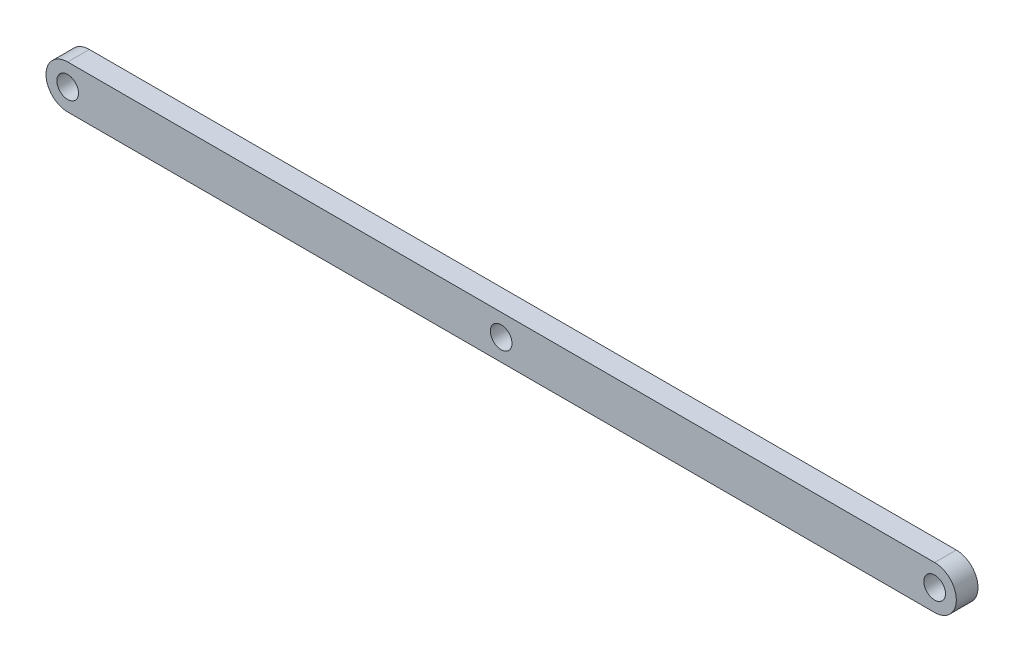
ISO-10303-21;
HEADER;
FILE_DESCRIPTION(('STEP AP214'),'2;1');
FILE_NAME('part.step','',(''),(''),'','','');
FILE_SCHEMA(('AUTOMOTIVE_DESIGN { 1 0 10303 214 1 1 1 1 }'));
ENDSEC;
DATA;
#1=APPLICATION_CONTEXT('core data for automotive mechanical design processes');
#2=APPLICATION_PROTOCOL_DEFINITION('international standard','automotive_design',2000,#1);
#3=PRODUCT_CONTEXT('',#1,'mechanical');
#4=PRODUCT('Part','Part','',(#3));
#5=PRODUCT_RELATED_PRODUCT_CATEGORY('part','',(#4));
#6=PRODUCT_DEFINITION_FORMATION('','',#4);
#7=PRODUCT_DEFINITION_CONTEXT('part definition',#1,'design');
#8=PRODUCT_DEFINITION('design','',#6,#7);
#9=PRODUCT_DEFINITION_SHAPE('','',#8);
#10=(LENGTH_UNIT() NAMED_UNIT(*) SI_UNIT(.MILLI.,.METRE.));
#11=(NAMED_UNIT(*) PLANE_ANGLE_UNIT() SI_UNIT($,.RADIAN.));
#12=(NAMED_UNIT(*) SI_UNIT($,.STERADIAN.) SOLID_ANGLE_UNIT());
#13=UNCERTAINTY_MEASURE_WITH_UNIT(LENGTH_MEASURE(1.E-05),#10,'distance_accuracy_value','');
#14=(GEOMETRIC_REPRESENTATION_CONTEXT(3) GLOBAL_UNCERTAINTY_ASSIGNED_CONTEXT((#13)) GLOBAL_UNIT_ASSIGNED_CONTEXT((#10,
#11,#12)) REPRESENTATION_CONTEXT('',''));
#15=CARTESIAN_POINT('',(0.,0.,0.));
#16=DIRECTION('',(0.,0.,1.));
#17=DIRECTION('',(1.,0.,0.));
#18=AXIS2_PLACEMENT_3D('',#15,#16,#17);
#19=CARTESIAN_POINT('',(0.,0.,3.175));
#20=DIRECTION('',(0.,0.,1.));
#21=DIRECTION('',(1.,0.,0.));
#22=AXIS2_PLACEMENT_3D('',#19,#20,#21);
#23=PLANE('',#22);
#24=CARTESIAN_POINT('',(127.,0.,3.175));
#25=DIRECTION('',(0.,0.,1.));
#26=DIRECTION('',(1.,0.,0.));
#27=AXIS2_PLACEMENT_3D('',#24,#25,#26);
#28=CIRCLE('',#27,1.58749999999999);
#29=CARTESIAN_POINT('',(128.5875,0.,3.175));
#30=VERTEX_POINT('',#29);
#31=EDGE_CURVE('E134',#30,#30,#28,.T.);
#32=ORIENTED_EDGE('',*,*,#31,.F.);
#33=EDGE_LOOP('',(#32));
#34=FACE_BOUND('',#33,.T.);
#35=CARTESIAN_POINT('',(0.,0.,3.175));
#36=DIRECTION('',(0.,0.,1.));
#37=DIRECTION('',(1.,0.,0.));
#38=AXIS2_PLACEMENT_3D('',#35,#36,#37);
#39=CIRCLE('',#38,3.175);
#40=CARTESIAN_POINT('',(0.,3.175,3.175));
#41=VERTEX_POINT('',#40);
#42=CARTESIAN_POINT('',(0.,-3.175,3.175));
#43=VERTEX_POINT('',#42);
#44=EDGE_CURVE('E92',#41,#43,#39,.T.);
#45=ORIENTED_EDGE('',*,*,#44,.T.);
#46=DIRECTION('',(1.,0.,0.));
#47=VECTOR('',#46,1.);
#48=CARTESIAN_POINT('',(0.,-3.175,3.175));
#49=LINE('',#48,#47);
#50=CARTESIAN_POINT('',(127.,-3.175,3.175));
#51=VERTEX_POINT('',#50);
#52=EDGE_CURVE('E87',#43,#51,#49,.T.);
#53=ORIENTED_EDGE('',*,*,#52,.T.);
#54=CARTESIAN_POINT('',(127.,0.,3.175));
#55=DIRECTION('',(0.,0.,1.));
#56=DIRECTION('',(1.,0.,0.));
#57=AXIS2_PLACEMENT_3D('',#54,#55,#56);
#58=CIRCLE('',#57,3.175);
#59=CARTESIAN_POINT('',(127.,3.175,3.175));
#60=VERTEX_POINT('',#59);
#61=EDGE_CURVE('E90',#51,#60,#58,.T.);
#62=ORIENTED_EDGE('',*,*,#61,.T.);
#63=DIRECTION('',(-1.,0.,0.));
#64=VECTOR('',#63,1.);
#65=CARTESIAN_POINT('',(0.,3.175,3.175));
#66=LINE('',#65,#64);
#67=EDGE_CURVE('E57',#60,#41,#66,.T.);
#68=ORIENTED_EDGE('',*,*,#67,.T.);
#69=EDGE_LOOP('',(#45,#53,#62,#68));
#70=FACE_BOUND('',#69,.T.);
#71=CARTESIAN_POINT('',(0.,0.,3.175));
#72=DIRECTION('',(0.,0.,1.));
#73=DIRECTION('',(1.,0.,0.));
#74=AXIS2_PLACEMENT_3D('',#71,#72,#73);
#75=CIRCLE('',#74,1.5875);
#76=CARTESIAN_POINT('',(1.5875,0.,3.175));
#77=VERTEX_POINT('',#76);
#78=EDGE_CURVE('E112',#77,#77,#75,.T.);
#79=ORIENTED_EDGE('',*,*,#78,.F.);
#80=EDGE_LOOP('',(#79));
#81=FACE_BOUND('',#80,.T.);
#82=CARTESIAN_POINT('',(63.5,0.,3.175));
#83=DIRECTION('',(0.,0.,1.));
#84=DIRECTION('',(1.,0.,0.));
#85=AXIS2_PLACEMENT_3D('',#82,#83,#84);
#86=CIRCLE('',#85,1.5875);
#87=CARTESIAN_POINT('',(65.0875,0.,3.175));
#88=VERTEX_POINT('',#87);
#89=EDGE_CURVE('E142',#88,#88,#86,.T.);
#90=ORIENTED_EDGE('',*,*,#89,.F.);
#91=EDGE_LOOP('',(#90));
#92=FACE_BOUND('',#91,.T.);
#93=ADVANCED_FACE('F39',(#34,#70,#81,#92),#23,.T.);
#94=CARTESIAN_POINT('',(0.,0.,0.));
#95=DIRECTION('',(0.,0.,1.));
#96=DIRECTION('',(1.,0.,0.));
#97=AXIS2_PLACEMENT_3D('',#94,#95,#96);
#98=PLANE('',#97);
#99=CARTESIAN_POINT('',(0.,0.,0.));
#100=DIRECTION('',(0.,0.,1.));
#101=DIRECTION('',(1.,0.,0.));
#102=AXIS2_PLACEMENT_3D('',#99,#100,#101);
#103=CIRCLE('',#102,3.175);
#104=CARTESIAN_POINT('',(0.,3.175,0.));
#105=VERTEX_POINT('',#104);
#106=CARTESIAN_POINT('',(0.,-3.175,0.));
#107=VERTEX_POINT('',#106);
#108=EDGE_CURVE('E108',#105,#107,#103,.T.);
#109=ORIENTED_EDGE('',*,*,#108,.F.);
#110=DIRECTION('',(-1.,0.,0.));
#111=VECTOR('',#110,1.);
#112=CARTESIAN_POINT('',(0.,3.175,0.));
#113=LINE('',#112,#111);
#114=CARTESIAN_POINT('',(127.,3.175,0.));
#115=VERTEX_POINT('',#114);
#116=EDGE_CURVE('E80',#115,#105,#113,.T.);
#117=ORIENTED_EDGE('',*,*,#116,.F.);
#118=CARTESIAN_POINT('',(127.,0.,0.));
#119=DIRECTION('',(0.,0.,1.));
#120=DIRECTION('',(1.,0.,0.));
#121=AXIS2_PLACEMENT_3D('',#118,#119,#120);
#122=CIRCLE('',#121,3.175);
#123=CARTESIAN_POINT('',(127.,-3.175,0.));
#124=VERTEX_POINT('',#123);
#125=EDGE_CURVE('E74',#124,#115,#122,.T.);
#126=ORIENTED_EDGE('',*,*,#125,.F.);
#127=DIRECTION('',(1.,0.,0.));
#128=VECTOR('',#127,1.);
#129=CARTESIAN_POINT('',(0.,-3.175,0.));
#130=LINE('',#129,#128);
#131=EDGE_CURVE('E97',#107,#124,#130,.T.);
#132=ORIENTED_EDGE('',*,*,#131,.F.);
#133=EDGE_LOOP('',(#109,#117,#126,#132));
#134=FACE_BOUND('',#133,.T.);
#135=CARTESIAN_POINT('',(0.,0.,0.));
#136=DIRECTION('',(0.,0.,1.));
#137=DIRECTION('',(1.,0.,0.));
#138=AXIS2_PLACEMENT_3D('',#135,#136,#137);
#139=CIRCLE('',#138,1.5875);
#140=CARTESIAN_POINT('',(1.5875,0.,0.));
#141=VERTEX_POINT('',#140);
#142=EDGE_CURVE('E130',#141,#141,#139,.T.);
#143=ORIENTED_EDGE('',*,*,#142,.T.);
#144=EDGE_LOOP('',(#143));
#145=FACE_BOUND('',#144,.T.);
#146=CARTESIAN_POINT('',(127.,0.,0.));
#147=DIRECTION('',(0.,0.,1.));
#148=DIRECTION('',(1.,0.,0.));
#149=AXIS2_PLACEMENT_3D('',#146,#147,#148);
#150=CIRCLE('',#149,1.58749999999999);
#151=CARTESIAN_POINT('',(128.5875,0.,0.));
#152=VERTEX_POINT('',#151);
#153=EDGE_CURVE('E138',#152,#152,#150,.T.);
#154=ORIENTED_EDGE('',*,*,#153,.T.);
#155=EDGE_LOOP('',(#154));
#156=FACE_BOUND('',#155,.T.);
#157=CARTESIAN_POINT('',(63.5,0.,0.));
#158=DIRECTION('',(0.,0.,1.));
#159=DIRECTION('',(1.,0.,0.));
#160=AXIS2_PLACEMENT_3D('',#157,#158,#159);
#161=CIRCLE('',#160,1.5875);
#162=CARTESIAN_POINT('',(65.0875,0.,0.));
#163=VERTEX_POINT('',#162);
#164=EDGE_CURVE('E146',#163,#163,#161,.T.);
#165=ORIENTED_EDGE('',*,*,#164,.T.);
#166=EDGE_LOOP('',(#165));
#167=FACE_BOUND('',#166,.T.);
#168=ADVANCED_FACE('F125',(#134,#145,#156,#167),#98,.F.);
#169=CARTESIAN_POINT('',(0.,0.,3.175));
#170=DIRECTION('',(0.,0.,-1.));
#171=DIRECTION('',(-1.,0.,0.));
#172=AXIS2_PLACEMENT_3D('',#169,#170,#171);
#173=CYLINDRICAL_SURFACE('',#172,3.175);
#174=ORIENTED_EDGE('',*,*,#108,.T.);
#175=DIRECTION('',(0.,0.,-1.));
#176=VECTOR('',#175,1.);
#177=CARTESIAN_POINT('',(0.,-3.175,3.175));
#178=LINE('',#177,#176);
#179=EDGE_CURVE('E11',#43,#107,#178,.T.);
#180=ORIENTED_EDGE('',*,*,#179,.F.);
#181=ORIENTED_EDGE('',*,*,#44,.F.);
#182=DIRECTION('',(0.,0.,-1.));
#183=VECTOR('',#182,1.);
#184=CARTESIAN_POINT('',(0.,3.175,3.175));
#185=LINE('',#184,#183);
#186=EDGE_CURVE('E104',#41,#105,#185,.T.);
#187=ORIENTED_EDGE('',*,*,#186,.T.);
#188=EDGE_LOOP('',(#174,#180,#181,#187));
#189=FACE_BOUND('',#188,.T.);
#190=ADVANCED_FACE('F41',(#189),#173,.T.);
#191=CARTESIAN_POINT('',(0.,-3.175,3.175));
#192=DIRECTION('',(0.,1.,0.));
#193=DIRECTION('',(-1.,0.,0.));
#194=AXIS2_PLACEMENT_3D('',#191,#192,#193);
#195=PLANE('',#194);
#196=ORIENTED_EDGE('',*,*,#131,.T.);
#197=DIRECTION('',(0.,0.,-1.));
#198=VECTOR('',#197,1.);
#199=CARTESIAN_POINT('',(127.,-3.175,3.175));
#200=LINE('',#199,#198);
#201=EDGE_CURVE('E49',#51,#124,#200,.T.);
#202=ORIENTED_EDGE('',*,*,#201,.F.);
#203=ORIENTED_EDGE('',*,*,#52,.F.);
#204=ORIENTED_EDGE('',*,*,#179,.T.);
#205=EDGE_LOOP('',(#196,#202,#203,#204));
#206=FACE_BOUND('',#205,.T.);
#207=ADVANCED_FACE('F96',(#206),#195,.F.);
#208=CARTESIAN_POINT('',(127.,0.,3.175));
#209=DIRECTION('',(0.,0.,-1.));
#210=DIRECTION('',(-1.,0.,0.));
#211=AXIS2_PLACEMENT_3D('',#208,#209,#210);
#212=CYLINDRICAL_SURFACE('',#211,3.175);
#213=ORIENTED_EDGE('',*,*,#125,.T.);
#214=DIRECTION('',(0.,0.,-1.));
#215=VECTOR('',#214,1.);
#216=CARTESIAN_POINT('',(127.,3.175,3.175));
#217=LINE('',#216,#215);
#218=EDGE_CURVE('E99',#60,#115,#217,.T.);
#219=ORIENTED_EDGE('',*,*,#218,.F.);
#220=ORIENTED_EDGE('',*,*,#61,.F.);
#221=ORIENTED_EDGE('',*,*,#201,.T.);
#222=EDGE_LOOP('',(#213,#219,#220,#221));
#223=FACE_BOUND('',#222,.T.);
#224=ADVANCED_FACE('F100',(#223),#212,.T.);
#225=CARTESIAN_POINT('',(0.,3.175,3.175));
#226=DIRECTION('',(0.,-1.,0.));
#227=DIRECTION('',(1.,0.,0.));
#228=AXIS2_PLACEMENT_3D('',#225,#226,#227);
#229=PLANE('',#228);
#230=ORIENTED_EDGE('',*,*,#116,.T.);
#231=ORIENTED_EDGE('',*,*,#186,.F.);
#232=ORIENTED_EDGE('',*,*,#67,.F.);
#233=ORIENTED_EDGE('',*,*,#218,.T.);
#234=EDGE_LOOP('',(#230,#231,#232,#233));
#235=FACE_BOUND('',#234,.T.);
#236=ADVANCED_FACE('F122',(#235),#229,.F.);
#237=CARTESIAN_POINT('',(0.,0.,3.175));
#238=DIRECTION('',(0.,0.,-1.));
#239=DIRECTION('',(-1.,0.,0.));
#240=AXIS2_PLACEMENT_3D('',#237,#238,#239);
#241=CYLINDRICAL_SURFACE('',#240,1.5875);
#242=ORIENTED_EDGE('',*,*,#78,.T.);
#243=EDGE_LOOP('',(#242));
#244=FACE_BOUND('',#243,.T.);
#245=ORIENTED_EDGE('',*,*,#142,.F.);
#246=EDGE_LOOP('',(#245));
#247=FACE_BOUND('',#246,.T.);
#248=ADVANCED_FACE('F166',(#244,#247),#241,.F.);
#249=CARTESIAN_POINT('',(127.,0.,3.175));
#250=DIRECTION('',(0.,0.,-1.));
#251=DIRECTION('',(-1.,0.,0.));
#252=AXIS2_PLACEMENT_3D('',#249,#250,#251);
#253=CYLINDRICAL_SURFACE('',#252,1.58749999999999);
#254=ORIENTED_EDGE('',*,*,#31,.T.);
#255=EDGE_LOOP('',(#254));
#256=FACE_BOUND('',#255,.T.);
#257=ORIENTED_EDGE('',*,*,#153,.F.);
#258=EDGE_LOOP('',(#257));
#259=FACE_BOUND('',#258,.T.);
#260=ADVANCED_FACE('F212',(#256,#259),#253,.F.);
#261=CARTESIAN_POINT('',(63.5,0.,3.175));
#262=DIRECTION('',(0.,0.,-1.));
#263=DIRECTION('',(-1.,0.,0.));
#264=AXIS2_PLACEMENT_3D('',#261,#262,#263);
#265=CYLINDRICAL_SURFACE('',#264,1.5875);
#266=ORIENTED_EDGE('',*,*,#89,.T.);
#267=EDGE_LOOP('',(#266));
#268=FACE_BOUND('',#267,.T.);
#269=ORIENTED_EDGE('',*,*,#164,.F.);
#270=EDGE_LOOP('',(#269));
#271=FACE_BOUND('',#270,.T.);
#272=ADVANCED_FACE('F154',(#268,#271),#265,.F.);
#273=CLOSED_SHELL('',(#93,#168,#190,#207,#224,#236,#248,#260,#272));
#274=MANIFOLD_SOLID_BREP('B2',#273);
#275=ADVANCED_BREP_SHAPE_REPRESENTATION('',(#18,#274),#14);
#276=SHAPE_DEFINITION_REPRESENTATION(#9,#275);
ENDSEC;
END-ISO-10303-21;
